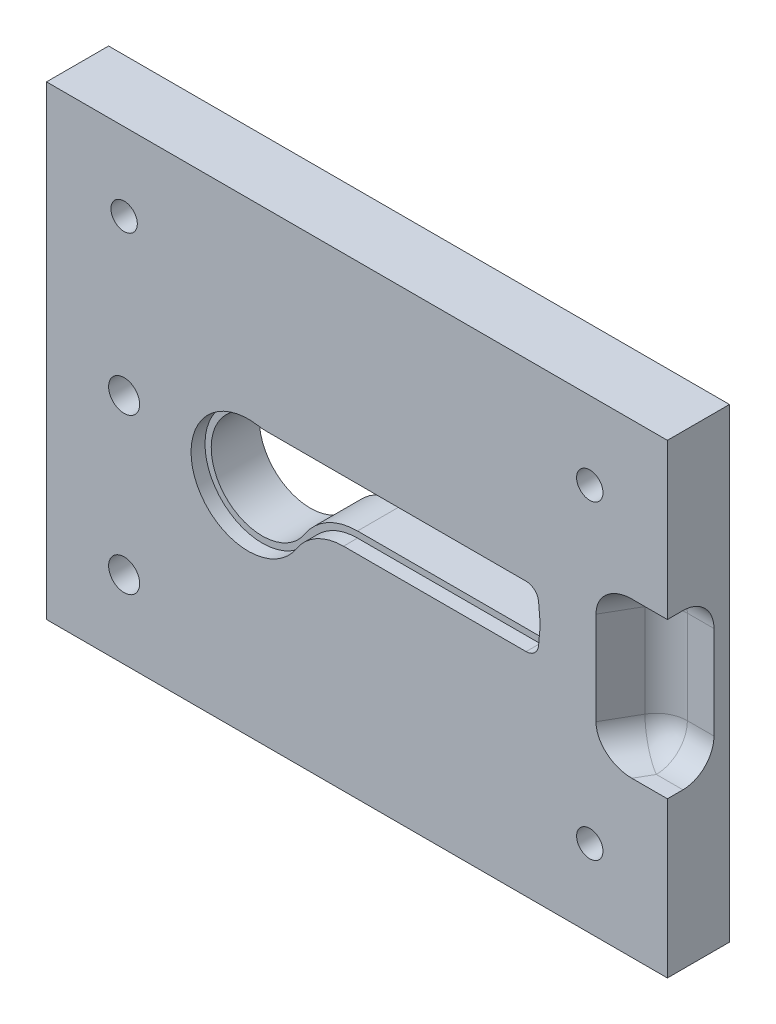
ISO-10303-21;
HEADER;
FILE_DESCRIPTION(('STEP AP214'),'2;1');
FILE_NAME('part.step','',(''),(''),'','','');
FILE_SCHEMA(('AUTOMOTIVE_DESIGN { 1 0 10303 214 1 1 1 1 }'));
ENDSEC;
DATA;
#1=APPLICATION_CONTEXT('core data for automotive mechanical design processes');
#2=APPLICATION_PROTOCOL_DEFINITION('international standard','automotive_design',2000,#1);
#3=PRODUCT_CONTEXT('',#1,'mechanical');
#4=PRODUCT('Part','Part','',(#3));
#5=PRODUCT_RELATED_PRODUCT_CATEGORY('part','',(#4));
#6=PRODUCT_DEFINITION_FORMATION('','',#4);
#7=PRODUCT_DEFINITION_CONTEXT('part definition',#1,'design');
#8=PRODUCT_DEFINITION('design','',#6,#7);
#9=PRODUCT_DEFINITION_SHAPE('','',#8);
#10=(LENGTH_UNIT() NAMED_UNIT(*) SI_UNIT(.MILLI.,.METRE.));
#11=(NAMED_UNIT(*) PLANE_ANGLE_UNIT() SI_UNIT($,.RADIAN.));
#12=(NAMED_UNIT(*) SI_UNIT($,.STERADIAN.) SOLID_ANGLE_UNIT());
#13=UNCERTAINTY_MEASURE_WITH_UNIT(LENGTH_MEASURE(1.E-05),#10,'distance_accuracy_value','');
#14=(GEOMETRIC_REPRESENTATION_CONTEXT(3) GLOBAL_UNCERTAINTY_ASSIGNED_CONTEXT((#13)) GLOBAL_UNIT_ASSIGNED_CONTEXT((#10,
#11,#12)) REPRESENTATION_CONTEXT('',''));
#15=CARTESIAN_POINT('',(0.,0.,0.));
#16=DIRECTION('',(0.,0.,1.));
#17=DIRECTION('',(1.,0.,0.));
#18=AXIS2_PLACEMENT_3D('',#15,#16,#17);
#19=CARTESIAN_POINT('',(25.,75.,20.));
#20=DIRECTION('',(0.,0.,1.));
#21=DIRECTION('',(1.,0.,0.));
#22=AXIS2_PLACEMENT_3D('',#19,#20,#21);
#23=CYLINDRICAL_SURFACE('',#22,4.99999999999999);
#24=CARTESIAN_POINT('',(25.,75.,20.));
#25=DIRECTION('',(0.,0.,1.));
#26=DIRECTION('',(1.,0.,0.));
#27=AXIS2_PLACEMENT_3D('',#24,#25,#26);
#28=CIRCLE('',#27,4.99999999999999);
#29=CARTESIAN_POINT('',(30.,75.,20.));
#30=VERTEX_POINT('',#29);
#31=EDGE_CURVE('E1024',#30,#30,#28,.T.);
#32=ORIENTED_EDGE('',*,*,#31,.T.);
#33=EDGE_LOOP('',(#32));
#34=FACE_BOUND('',#33,.T.);
#35=CARTESIAN_POINT('',(25.,75.,5.));
#36=DIRECTION('',(0.,0.,-1.));
#37=DIRECTION('',(-1.,0.,0.));
#38=AXIS2_PLACEMENT_3D('',#35,#36,#37);
#39=CIRCLE('',#38,4.99999999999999);
#40=CARTESIAN_POINT('',(20.,75.,5.));
#41=VERTEX_POINT('',#40);
#42=EDGE_CURVE('E35',#41,#41,#39,.F.);
#43=ORIENTED_EDGE('',*,*,#42,.F.);
#44=EDGE_LOOP('',(#43));
#45=FACE_BOUND('',#44,.T.);
#46=ADVANCED_FACE('F31',(#34,#45),#23,.F.);
#47=CARTESIAN_POINT('',(175.,125.,20.));
#48=DIRECTION('',(0.,0.,1.));
#49=DIRECTION('',(1.,0.,0.));
#50=AXIS2_PLACEMENT_3D('',#47,#48,#49);
#51=CYLINDRICAL_SURFACE('',#50,4.24999999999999);
#52=CARTESIAN_POINT('',(175.,125.,20.));
#53=DIRECTION('',(0.,0.,1.));
#54=DIRECTION('',(1.,0.,0.));
#55=AXIS2_PLACEMENT_3D('',#52,#53,#54);
#56=CIRCLE('',#55,4.24999999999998);
#57=CARTESIAN_POINT('',(179.25,125.,20.));
#58=VERTEX_POINT('',#57);
#59=EDGE_CURVE('E284',#58,#58,#56,.T.);
#60=ORIENTED_EDGE('',*,*,#59,.T.);
#61=EDGE_LOOP('',(#60));
#62=FACE_BOUND('',#61,.T.);
#63=CARTESIAN_POINT('',(175.,125.,5.));
#64=DIRECTION('',(0.,0.,-1.));
#65=DIRECTION('',(-1.,0.,0.));
#66=AXIS2_PLACEMENT_3D('',#63,#64,#65);
#67=CIRCLE('',#66,4.24999999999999);
#68=CARTESIAN_POINT('',(170.75,125.,5.));
#69=VERTEX_POINT('',#68);
#70=EDGE_CURVE('E291',#69,#69,#67,.F.);
#71=ORIENTED_EDGE('',*,*,#70,.F.);
#72=EDGE_LOOP('',(#71));
#73=FACE_BOUND('',#72,.T.);
#74=ADVANCED_FACE('F572',(#62,#73),#51,.F.);
#75=CARTESIAN_POINT('',(175.,25.,20.));
#76=DIRECTION('',(0.,0.,1.));
#77=DIRECTION('',(1.,0.,0.));
#78=AXIS2_PLACEMENT_3D('',#75,#76,#77);
#79=CYLINDRICAL_SURFACE('',#78,4.24999999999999);
#80=CARTESIAN_POINT('',(175.,25.,20.));
#81=DIRECTION('',(0.,0.,1.));
#82=DIRECTION('',(1.,0.,0.));
#83=AXIS2_PLACEMENT_3D('',#80,#81,#82);
#84=CIRCLE('',#83,4.24999999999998);
#85=CARTESIAN_POINT('',(179.25,25.,20.));
#86=VERTEX_POINT('',#85);
#87=EDGE_CURVE('E374',#86,#86,#84,.T.);
#88=ORIENTED_EDGE('',*,*,#87,.T.);
#89=EDGE_LOOP('',(#88));
#90=FACE_BOUND('',#89,.T.);
#91=CARTESIAN_POINT('',(175.,25.,5.));
#92=DIRECTION('',(0.,0.,-1.));
#93=DIRECTION('',(-1.,0.,0.));
#94=AXIS2_PLACEMENT_3D('',#91,#92,#93);
#95=CIRCLE('',#94,4.24999999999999);
#96=CARTESIAN_POINT('',(170.75,25.,5.));
#97=VERTEX_POINT('',#96);
#98=EDGE_CURVE('E286',#97,#97,#95,.F.);
#99=ORIENTED_EDGE('',*,*,#98,.F.);
#100=EDGE_LOOP('',(#99));
#101=FACE_BOUND('',#100,.T.);
#102=ADVANCED_FACE('F578',(#90,#101),#79,.F.);
#103=CARTESIAN_POINT('',(25.,125.,20.));
#104=DIRECTION('',(0.,0.,1.));
#105=DIRECTION('',(1.,0.,0.));
#106=AXIS2_PLACEMENT_3D('',#103,#104,#105);
#107=CYLINDRICAL_SURFACE('',#106,4.24999999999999);
#108=CARTESIAN_POINT('',(25.,125.,20.));
#109=DIRECTION('',(0.,0.,1.));
#110=DIRECTION('',(1.,0.,0.));
#111=AXIS2_PLACEMENT_3D('',#108,#109,#110);
#112=CIRCLE('',#111,4.24999999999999);
#113=CARTESIAN_POINT('',(29.25,125.,20.));
#114=VERTEX_POINT('',#113);
#115=EDGE_CURVE('E371',#114,#114,#112,.T.);
#116=ORIENTED_EDGE('',*,*,#115,.T.);
#117=EDGE_LOOP('',(#116));
#118=FACE_BOUND('',#117,.T.);
#119=CARTESIAN_POINT('',(25.,125.,5.));
#120=DIRECTION('',(0.,0.,-1.));
#121=DIRECTION('',(-1.,0.,0.));
#122=AXIS2_PLACEMENT_3D('',#119,#120,#121);
#123=CIRCLE('',#122,4.24999999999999);
#124=CARTESIAN_POINT('',(20.75,125.,5.));
#125=VERTEX_POINT('',#124);
#126=EDGE_CURVE('E281',#125,#125,#123,.F.);
#127=ORIENTED_EDGE('',*,*,#126,.F.);
#128=EDGE_LOOP('',(#127));
#129=FACE_BOUND('',#128,.T.);
#130=ADVANCED_FACE('F631',(#118,#129),#107,.F.);
#131=CARTESIAN_POINT('',(0.,150.,0.));
#132=DIRECTION('',(0.,0.,-1.));
#133=DIRECTION('',(-1.,0.,0.));
#134=AXIS2_PLACEMENT_3D('',#131,#132,#133);
#135=PLANE('',#134);
#136=CARTESIAN_POINT('',(25.,75.,0.));
#137=DIRECTION('',(0.,0.,-1.));
#138=DIRECTION('',(-1.,0.,0.));
#139=AXIS2_PLACEMENT_3D('',#136,#137,#138);
#140=CIRCLE('',#139,13.);
#141=CARTESIAN_POINT('',(12.,75.,0.));
#142=VERTEX_POINT('',#141);
#143=EDGE_CURVE('E1020',#142,#142,#140,.T.);
#144=ORIENTED_EDGE('',*,*,#143,.F.);
#145=EDGE_LOOP('',(#144));
#146=FACE_BOUND('',#145,.T.);
#147=CARTESIAN_POINT('',(175.,125.,0.));
#148=DIRECTION('',(0.,0.,-1.));
#149=DIRECTION('',(-1.,0.,0.));
#150=AXIS2_PLACEMENT_3D('',#147,#148,#149);
#151=CIRCLE('',#150,13.);
#152=CARTESIAN_POINT('',(162.,125.,0.));
#153=VERTEX_POINT('',#152);
#154=EDGE_CURVE('E233',#153,#153,#151,.T.);
#155=ORIENTED_EDGE('',*,*,#154,.F.);
#156=EDGE_LOOP('',(#155));
#157=FACE_BOUND('',#156,.T.);
#158=CARTESIAN_POINT('',(175.,25.,0.));
#159=DIRECTION('',(0.,0.,-1.));
#160=DIRECTION('',(-1.,0.,0.));
#161=AXIS2_PLACEMENT_3D('',#158,#159,#160);
#162=CIRCLE('',#161,13.);
#163=CARTESIAN_POINT('',(162.,25.,0.));
#164=VERTEX_POINT('',#163);
#165=EDGE_CURVE('E294',#164,#164,#162,.T.);
#166=ORIENTED_EDGE('',*,*,#165,.F.);
#167=EDGE_LOOP('',(#166));
#168=FACE_BOUND('',#167,.T.);
#169=CARTESIAN_POINT('',(25.,25.,0.));
#170=DIRECTION('',(0.,0.,-1.));
#171=DIRECTION('',(-1.,0.,0.));
#172=AXIS2_PLACEMENT_3D('',#169,#170,#171);
#173=CIRCLE('',#172,13.);
#174=CARTESIAN_POINT('',(12.,25.,0.));
#175=VERTEX_POINT('',#174);
#176=EDGE_CURVE('E289',#175,#175,#173,.T.);
#177=ORIENTED_EDGE('',*,*,#176,.F.);
#178=EDGE_LOOP('',(#177));
#179=FACE_BOUND('',#178,.T.);
#180=CARTESIAN_POINT('',(25.,125.,0.));
#181=DIRECTION('',(0.,0.,-1.));
#182=DIRECTION('',(-1.,0.,0.));
#183=AXIS2_PLACEMENT_3D('',#180,#181,#182);
#184=CIRCLE('',#183,13.);
#185=CARTESIAN_POINT('',(12.,125.,0.));
#186=VERTEX_POINT('',#185);
#187=EDGE_CURVE('E362',#186,#186,#184,.T.);
#188=ORIENTED_EDGE('',*,*,#187,.F.);
#189=EDGE_LOOP('',(#188));
#190=FACE_BOUND('',#189,.T.);
#191=DIRECTION('',(0.,-1.,0.));
#192=VECTOR('',#191,1.);
#193=CARTESIAN_POINT('',(0.,0.,0.));
#194=LINE('',#193,#192);
#195=CARTESIAN_POINT('',(0.,150.,0.));
#196=VERTEX_POINT('',#195);
#197=CARTESIAN_POINT('',(0.,0.,0.));
#198=VERTEX_POINT('',#197);
#199=EDGE_CURVE('E257',#196,#198,#194,.T.);
#200=ORIENTED_EDGE('',*,*,#199,.F.);
#201=DIRECTION('',(-1.,0.,0.));
#202=VECTOR('',#201,1.);
#203=CARTESIAN_POINT('',(0.,150.,0.));
#204=LINE('',#203,#202);
#205=CARTESIAN_POINT('',(200.,150.,0.));
#206=VERTEX_POINT('',#205);
#207=EDGE_CURVE('E265',#206,#196,#204,.T.);
#208=ORIENTED_EDGE('',*,*,#207,.F.);
#209=DIRECTION('',(0.,1.,0.));
#210=VECTOR('',#209,1.);
#211=CARTESIAN_POINT('',(200.,0.,0.));
#212=LINE('',#211,#210);
#213=CARTESIAN_POINT('',(200.,0.,0.));
#214=VERTEX_POINT('',#213);
#215=EDGE_CURVE('E263',#214,#206,#212,.T.);
#216=ORIENTED_EDGE('',*,*,#215,.F.);
#217=DIRECTION('',(1.,0.,0.));
#218=VECTOR('',#217,1.);
#219=CARTESIAN_POINT('',(0.,0.,0.));
#220=LINE('',#219,#218);
#221=EDGE_CURVE('E260',#198,#214,#220,.T.);
#222=ORIENTED_EDGE('',*,*,#221,.F.);
#223=EDGE_LOOP('',(#200,#208,#216,#222));
#224=FACE_BOUND('',#223,.T.);
#225=CARTESIAN_POINT('',(71.0781905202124,105.965,0.));
#226=DIRECTION('',(0.,0.,-1.));
#227=DIRECTION('',(-1.,0.,0.));
#228=AXIS2_PLACEMENT_3D('',#225,#226,#227);
#229=CIRCLE('',#228,20.03);
#230=CARTESIAN_POINT('',(71.0781905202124,85.935,0.));
#231=VERTEX_POINT('',#230);
#232=CARTESIAN_POINT('',(67.7403932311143,86.2150630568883,0.));
#233=VERTEX_POINT('',#232);
#234=EDGE_CURVE('E465',#231,#233,#229,.T.);
#235=ORIENTED_EDGE('',*,*,#234,.T.);
#236=CARTESIAN_POINT('',(65.,70.,0.));
#237=DIRECTION('',(0.,0.,1.));
#238=DIRECTION('',(1.,0.,0.));
#239=AXIS2_PLACEMENT_3D('',#236,#237,#238);
#240=CIRCLE('',#239,16.445);
#241=CARTESIAN_POINT('',(78.8329287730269,61.1068505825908,0.));
#242=VERTEX_POINT('',#241);
#243=EDGE_CURVE('E468',#233,#242,#240,.T.);
#244=ORIENTED_EDGE('',*,*,#243,.T.);
#245=CARTESIAN_POINT('',(95.6814276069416,50.275,0.));
#246=DIRECTION('',(0.,0.,-1.));
#247=DIRECTION('',(1.,0.,0.));
#248=AXIS2_PLACEMENT_3D('',#245,#246,#247);
#249=CIRCLE('',#248,20.03);
#250=CARTESIAN_POINT('',(95.6814276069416,70.305,0.));
#251=VERTEX_POINT('',#250);
#252=EDGE_CURVE('E471',#242,#251,#249,.T.);
#253=ORIENTED_EDGE('',*,*,#252,.T.);
#254=DIRECTION('',(1.,0.,0.));
#255=VECTOR('',#254,1.);
#256=CARTESIAN_POINT('',(95.6814276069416,70.305,0.));
#257=LINE('',#256,#255);
#258=CARTESIAN_POINT('',(154.489847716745,70.305,0.));
#259=VERTEX_POINT('',#258);
#260=EDGE_CURVE('E474',#251,#259,#257,.T.);
#261=ORIENTED_EDGE('',*,*,#260,.T.);
#262=CARTESIAN_POINT('',(154.489847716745,72.335,0.));
#263=DIRECTION('',(0.,0.,1.));
#264=DIRECTION('',(1.,0.,0.));
#265=AXIS2_PLACEMENT_3D('',#262,#263,#264);
#266=CIRCLE('',#265,2.03);
#267=CARTESIAN_POINT('',(156.512122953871,72.1580738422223,0.));
#268=VERTEX_POINT('',#267);
#269=EDGE_CURVE('E477',#259,#268,#266,.T.);
#270=ORIENTED_EDGE('',*,*,#269,.T.);
#271=DIRECTION('',(0.0871557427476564,0.996194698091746,0.));
#272=VECTOR('',#271,1.);
#273=CARTESIAN_POINT('',(156.512122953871,72.1580738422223,0.));
#274=LINE('',#273,#272);
#275=CARTESIAN_POINT('',(157.033723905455,78.12,0.));
#276=VERTEX_POINT('',#275);
#277=EDGE_CURVE('E480',#268,#276,#274,.T.);
#278=ORIENTED_EDGE('',*,*,#277,.T.);
#279=DIRECTION('',(-0.0871557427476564,0.996194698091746,0.));
#280=VECTOR('',#279,1.);
#281=CARTESIAN_POINT('',(156.512122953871,84.0819261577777,0.));
#282=LINE('',#281,#280);
#283=CARTESIAN_POINT('',(156.512122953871,84.0819261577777,0.));
#284=VERTEX_POINT('',#283);
#285=EDGE_CURVE('E483',#276,#284,#282,.T.);
#286=ORIENTED_EDGE('',*,*,#285,.T.);
#287=CARTESIAN_POINT('',(154.489847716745,83.905,0.));
#288=DIRECTION('',(0.,0.,1.));
#289=DIRECTION('',(-1.,0.,0.));
#290=AXIS2_PLACEMENT_3D('',#287,#288,#289);
#291=CIRCLE('',#290,2.03);
#292=CARTESIAN_POINT('',(154.489847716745,85.935,0.));
#293=VERTEX_POINT('',#292);
#294=EDGE_CURVE('E486',#284,#293,#291,.T.);
#295=ORIENTED_EDGE('',*,*,#294,.T.);
#296=DIRECTION('',(-1.,0.,0.));
#297=VECTOR('',#296,1.);
#298=CARTESIAN_POINT('',(71.0781905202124,85.935,0.));
#299=LINE('',#298,#297);
#300=EDGE_CURVE('E489',#293,#231,#299,.T.);
#301=ORIENTED_EDGE('',*,*,#300,.T.);
#302=EDGE_LOOP('',(#235,#244,#253,#261,#270,#278,#286,#295,#301));
#303=FACE_BOUND('',#302,.T.);
#304=ADVANCED_FACE('F530',(#146,#157,#168,#179,#190,#224,#303),#135,.T.);
#305=CARTESIAN_POINT('',(71.0781905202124,105.965,0.));
#306=DIRECTION('',(0.,0.,1.));
#307=DIRECTION('',(1.,0.,0.));
#308=AXIS2_PLACEMENT_3D('',#305,#306,#307);
#309=CYLINDRICAL_SURFACE('',#308,20.03);
#310=CARTESIAN_POINT('',(71.0781905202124,105.965,15.5));
#311=DIRECTION('',(0.,0.,1.));
#312=DIRECTION('',(1.,0.,0.));
#313=AXIS2_PLACEMENT_3D('',#310,#311,#312);
#314=CIRCLE('',#313,20.03);
#315=CARTESIAN_POINT('',(67.7403932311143,86.2150630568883,15.5));
#316=VERTEX_POINT('',#315);
#317=CARTESIAN_POINT('',(71.0781905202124,85.935,15.5));
#318=VERTEX_POINT('',#317);
#319=EDGE_CURVE('E463',#316,#318,#314,.T.);
#320=ORIENTED_EDGE('',*,*,#319,.F.);
#321=DIRECTION('',(0.,0.,1.));
#322=VECTOR('',#321,1.);
#323=CARTESIAN_POINT('',(67.7403932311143,86.2150630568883,0.));
#324=LINE('',#323,#322);
#325=EDGE_CURVE('E492',#233,#316,#324,.T.);
#326=ORIENTED_EDGE('',*,*,#325,.F.);
#327=ORIENTED_EDGE('',*,*,#234,.F.);
#328=DIRECTION('',(0.,0.,1.));
#329=VECTOR('',#328,1.);
#330=CARTESIAN_POINT('',(71.0781905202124,85.935,0.));
#331=LINE('',#330,#329);
#332=EDGE_CURVE('E261',#231,#318,#331,.T.);
#333=ORIENTED_EDGE('',*,*,#332,.T.);
#334=EDGE_LOOP('',(#320,#326,#327,#333));
#335=FACE_BOUND('',#334,.T.);
#336=ADVANCED_FACE('F681',(#335),#309,.T.);
#337=CARTESIAN_POINT('',(71.0781905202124,85.935,0.));
#338=DIRECTION('',(0.,1.,0.));
#339=DIRECTION('',(-1.,0.,0.));
#340=AXIS2_PLACEMENT_3D('',#337,#338,#339);
#341=PLANE('',#340);
#342=DIRECTION('',(1.,0.,0.));
#343=VECTOR('',#342,1.);
#344=CARTESIAN_POINT('',(71.0781905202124,85.935,15.5));
#345=LINE('',#344,#343);
#346=CARTESIAN_POINT('',(154.489847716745,85.935,15.5));
#347=VERTEX_POINT('',#346);
#348=EDGE_CURVE('E461',#318,#347,#345,.T.);
#349=ORIENTED_EDGE('',*,*,#348,.F.);
#350=ORIENTED_EDGE('',*,*,#332,.F.);
#351=ORIENTED_EDGE('',*,*,#300,.F.);
#352=DIRECTION('',(0.,0.,1.));
#353=VECTOR('',#352,1.);
#354=CARTESIAN_POINT('',(154.489847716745,85.935,0.));
#355=LINE('',#354,#353);
#356=EDGE_CURVE('E495',#293,#347,#355,.T.);
#357=ORIENTED_EDGE('',*,*,#356,.T.);
#358=EDGE_LOOP('',(#349,#350,#351,#357));
#359=FACE_BOUND('',#358,.T.);
#360=ADVANCED_FACE('F677',(#359),#341,.F.);
#361=CARTESIAN_POINT('',(154.489847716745,83.905,0.));
#362=DIRECTION('',(0.,0.,1.));
#363=DIRECTION('',(1.,0.,0.));
#364=AXIS2_PLACEMENT_3D('',#361,#362,#363);
#365=CYLINDRICAL_SURFACE('',#364,2.03);
#366=CARTESIAN_POINT('',(154.489847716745,83.905,15.5));
#367=DIRECTION('',(0.,0.,1.));
#368=DIRECTION('',(1.,0.,0.));
#369=AXIS2_PLACEMENT_3D('',#366,#367,#368);
#370=CIRCLE('',#369,2.03);
#371=CARTESIAN_POINT('',(156.512122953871,84.0819261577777,15.5));
#372=VERTEX_POINT('',#371);
#373=EDGE_CURVE('E459',#347,#372,#370,.F.);
#374=ORIENTED_EDGE('',*,*,#373,.F.);
#375=ORIENTED_EDGE('',*,*,#356,.F.);
#376=ORIENTED_EDGE('',*,*,#294,.F.);
#377=DIRECTION('',(0.,0.,1.));
#378=VECTOR('',#377,1.);
#379=CARTESIAN_POINT('',(156.512122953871,84.0819261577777,0.));
#380=LINE('',#379,#378);
#381=EDGE_CURVE('E498',#284,#372,#380,.T.);
#382=ORIENTED_EDGE('',*,*,#381,.T.);
#383=EDGE_LOOP('',(#374,#375,#376,#382));
#384=FACE_BOUND('',#383,.T.);
#385=ADVANCED_FACE('F680',(#384),#365,.F.);
#386=CARTESIAN_POINT('',(156.512122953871,84.0819261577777,0.));
#387=DIRECTION('',(0.996194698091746,0.0871557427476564,0.));
#388=DIRECTION('',(-0.0871557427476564,0.996194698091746,0.));
#389=AXIS2_PLACEMENT_3D('',#386,#387,#388);
#390=PLANE('',#389);
#391=DIRECTION('',(0.0871557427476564,-0.996194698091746,0.));
#392=VECTOR('',#391,1.);
#393=CARTESIAN_POINT('',(156.512122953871,84.0819261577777,15.5));
#394=LINE('',#393,#392);
#395=CARTESIAN_POINT('',(157.033723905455,78.12,15.5));
#396=VERTEX_POINT('',#395);
#397=EDGE_CURVE('E457',#372,#396,#394,.T.);
#398=ORIENTED_EDGE('',*,*,#397,.F.);
#399=ORIENTED_EDGE('',*,*,#381,.F.);
#400=ORIENTED_EDGE('',*,*,#285,.F.);
#401=DIRECTION('',(0.,0.,1.));
#402=VECTOR('',#401,1.);
#403=CARTESIAN_POINT('',(157.033723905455,78.12,0.));
#404=LINE('',#403,#402);
#405=EDGE_CURVE('E501',#276,#396,#404,.T.);
#406=ORIENTED_EDGE('',*,*,#405,.T.);
#407=EDGE_LOOP('',(#398,#399,#400,#406));
#408=FACE_BOUND('',#407,.T.);
#409=ADVANCED_FACE('F685',(#408),#390,.F.);
#410=CARTESIAN_POINT('',(156.512122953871,72.1580738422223,0.));
#411=DIRECTION('',(0.996194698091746,-0.0871557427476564,0.));
#412=DIRECTION('',(0.0871557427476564,0.996194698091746,0.));
#413=AXIS2_PLACEMENT_3D('',#410,#411,#412);
#414=PLANE('',#413);
#415=DIRECTION('',(-0.0871557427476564,-0.996194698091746,0.));
#416=VECTOR('',#415,1.);
#417=CARTESIAN_POINT('',(156.512122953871,72.1580738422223,15.5));
#418=LINE('',#417,#416);
#419=CARTESIAN_POINT('',(156.512122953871,72.1580738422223,15.5));
#420=VERTEX_POINT('',#419);
#421=EDGE_CURVE('E455',#396,#420,#418,.T.);
#422=ORIENTED_EDGE('',*,*,#421,.F.);
#423=ORIENTED_EDGE('',*,*,#405,.F.);
#424=ORIENTED_EDGE('',*,*,#277,.F.);
#425=DIRECTION('',(0.,0.,1.));
#426=VECTOR('',#425,1.);
#427=CARTESIAN_POINT('',(156.512122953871,72.1580738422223,0.));
#428=LINE('',#427,#426);
#429=EDGE_CURVE('E504',#268,#420,#428,.T.);
#430=ORIENTED_EDGE('',*,*,#429,.T.);
#431=EDGE_LOOP('',(#422,#423,#424,#430));
#432=FACE_BOUND('',#431,.T.);
#433=ADVANCED_FACE('F689',(#432),#414,.F.);
#434=CARTESIAN_POINT('',(154.489847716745,72.335,0.));
#435=DIRECTION('',(0.,0.,1.));
#436=DIRECTION('',(1.,0.,0.));
#437=AXIS2_PLACEMENT_3D('',#434,#435,#436);
#438=CYLINDRICAL_SURFACE('',#437,2.03);
#439=CARTESIAN_POINT('',(154.489847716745,72.335,15.5));
#440=DIRECTION('',(0.,0.,1.));
#441=DIRECTION('',(1.,0.,0.));
#442=AXIS2_PLACEMENT_3D('',#439,#440,#441);
#443=CIRCLE('',#442,2.03);
#444=CARTESIAN_POINT('',(154.489847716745,70.305,15.5));
#445=VERTEX_POINT('',#444);
#446=EDGE_CURVE('E453',#420,#445,#443,.F.);
#447=ORIENTED_EDGE('',*,*,#446,.F.);
#448=ORIENTED_EDGE('',*,*,#429,.F.);
#449=ORIENTED_EDGE('',*,*,#269,.F.);
#450=DIRECTION('',(0.,0.,1.));
#451=VECTOR('',#450,1.);
#452=CARTESIAN_POINT('',(154.489847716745,70.305,0.));
#453=LINE('',#452,#451);
#454=EDGE_CURVE('E507',#259,#445,#453,.T.);
#455=ORIENTED_EDGE('',*,*,#454,.T.);
#456=EDGE_LOOP('',(#447,#448,#449,#455));
#457=FACE_BOUND('',#456,.T.);
#458=ADVANCED_FACE('F693',(#457),#438,.F.);
#459=CARTESIAN_POINT('',(95.6814276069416,70.305,0.));
#460=DIRECTION('',(0.,-1.,0.));
#461=DIRECTION('',(1.,0.,0.));
#462=AXIS2_PLACEMENT_3D('',#459,#460,#461);
#463=PLANE('',#462);
#464=DIRECTION('',(-1.,0.,0.));
#465=VECTOR('',#464,1.);
#466=CARTESIAN_POINT('',(95.6814276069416,70.305,15.5));
#467=LINE('',#466,#465);
#468=CARTESIAN_POINT('',(95.6814276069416,70.305,15.5));
#469=VERTEX_POINT('',#468);
#470=EDGE_CURVE('E451',#445,#469,#467,.T.);
#471=ORIENTED_EDGE('',*,*,#470,.F.);
#472=ORIENTED_EDGE('',*,*,#454,.F.);
#473=ORIENTED_EDGE('',*,*,#260,.F.);
#474=DIRECTION('',(0.,0.,1.));
#475=VECTOR('',#474,1.);
#476=CARTESIAN_POINT('',(95.6814276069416,70.305,0.));
#477=LINE('',#476,#475);
#478=EDGE_CURVE('E510',#251,#469,#477,.T.);
#479=ORIENTED_EDGE('',*,*,#478,.T.);
#480=EDGE_LOOP('',(#471,#472,#473,#479));
#481=FACE_BOUND('',#480,.T.);
#482=ADVANCED_FACE('F697',(#481),#463,.F.);
#483=CARTESIAN_POINT('',(95.6814276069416,50.275,0.));
#484=DIRECTION('',(0.,0.,1.));
#485=DIRECTION('',(1.,0.,0.));
#486=AXIS2_PLACEMENT_3D('',#483,#484,#485);
#487=CYLINDRICAL_SURFACE('',#486,20.03);
#488=CARTESIAN_POINT('',(95.6814276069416,50.275,15.5));
#489=DIRECTION('',(0.,0.,1.));
#490=DIRECTION('',(1.,0.,0.));
#491=AXIS2_PLACEMENT_3D('',#488,#489,#490);
#492=CIRCLE('',#491,20.03);
#493=CARTESIAN_POINT('',(78.8329287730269,61.1068505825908,15.5));
#494=VERTEX_POINT('',#493);
#495=EDGE_CURVE('E433',#469,#494,#492,.T.);
#496=ORIENTED_EDGE('',*,*,#495,.F.);
#497=ORIENTED_EDGE('',*,*,#478,.F.);
#498=ORIENTED_EDGE('',*,*,#252,.F.);
#499=DIRECTION('',(0.,0.,1.));
#500=VECTOR('',#499,1.);
#501=CARTESIAN_POINT('',(78.8329287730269,61.1068505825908,0.));
#502=LINE('',#501,#500);
#503=EDGE_CURVE('E513',#242,#494,#502,.T.);
#504=ORIENTED_EDGE('',*,*,#503,.T.);
#505=EDGE_LOOP('',(#496,#497,#498,#504));
#506=FACE_BOUND('',#505,.T.);
#507=ADVANCED_FACE('F701',(#506),#487,.T.);
#508=CARTESIAN_POINT('',(65.,70.,0.));
#509=DIRECTION('',(0.,0.,1.));
#510=DIRECTION('',(1.,0.,0.));
#511=AXIS2_PLACEMENT_3D('',#508,#509,#510);
#512=CYLINDRICAL_SURFACE('',#511,16.445);
#513=CARTESIAN_POINT('',(65.,70.,15.5));
#514=DIRECTION('',(0.,0.,1.));
#515=DIRECTION('',(1.,0.,0.));
#516=AXIS2_PLACEMENT_3D('',#513,#514,#515);
#517=CIRCLE('',#516,16.445);
#518=EDGE_CURVE('E278',#494,#316,#517,.F.);
#519=ORIENTED_EDGE('',*,*,#518,.F.);
#520=ORIENTED_EDGE('',*,*,#503,.F.);
#521=ORIENTED_EDGE('',*,*,#243,.F.);
#522=ORIENTED_EDGE('',*,*,#325,.T.);
#523=EDGE_LOOP('',(#519,#520,#521,#522));
#524=FACE_BOUND('',#523,.T.);
#525=ADVANCED_FACE('F705',(#524),#512,.F.);
#526=CARTESIAN_POINT('',(0.,0.,20.));
#527=DIRECTION('',(1.,0.,0.));
#528=DIRECTION('',(0.,0.,-1.));
#529=AXIS2_PLACEMENT_3D('',#526,#527,#528);
#530=PLANE('',#529);
#531=ORIENTED_EDGE('',*,*,#199,.T.);
#532=DIRECTION('',(0.,0.,-1.));
#533=VECTOR('',#532,1.);
#534=CARTESIAN_POINT('',(0.,0.,20.));
#535=LINE('',#534,#533);
#536=CARTESIAN_POINT('',(0.,0.,20.));
#537=VERTEX_POINT('',#536);
#538=EDGE_CURVE('E275',#537,#198,#535,.T.);
#539=ORIENTED_EDGE('',*,*,#538,.F.);
#540=DIRECTION('',(0.,-1.,0.));
#541=VECTOR('',#540,1.);
#542=CARTESIAN_POINT('',(0.,0.,20.));
#543=LINE('',#542,#541);
#544=CARTESIAN_POINT('',(0.,150.,20.));
#545=VERTEX_POINT('',#544);
#546=EDGE_CURVE('E267',#545,#537,#543,.T.);
#547=ORIENTED_EDGE('',*,*,#546,.F.);
#548=DIRECTION('',(0.,0.,-1.));
#549=VECTOR('',#548,1.);
#550=CARTESIAN_POINT('',(0.,150.,20.));
#551=LINE('',#550,#549);
#552=EDGE_CURVE('E252',#545,#196,#551,.T.);
#553=ORIENTED_EDGE('',*,*,#552,.T.);
#554=EDGE_LOOP('',(#531,#539,#547,#553));
#555=FACE_BOUND('',#554,.T.);
#556=ADVANCED_FACE('F522',(#555),#530,.F.);
#557=CARTESIAN_POINT('',(0.,0.,20.));
#558=DIRECTION('',(0.,1.,0.));
#559=DIRECTION('',(0.,0.,1.));
#560=AXIS2_PLACEMENT_3D('',#557,#558,#559);
#561=PLANE('',#560);
#562=ORIENTED_EDGE('',*,*,#221,.T.);
#563=DIRECTION('',(0.,0.,-1.));
#564=VECTOR('',#563,1.);
#565=CARTESIAN_POINT('',(200.,0.,20.));
#566=LINE('',#565,#564);
#567=CARTESIAN_POINT('',(200.,0.,20.));
#568=VERTEX_POINT('',#567);
#569=EDGE_CURVE('E273',#568,#214,#566,.T.);
#570=ORIENTED_EDGE('',*,*,#569,.F.);
#571=DIRECTION('',(1.,0.,0.));
#572=VECTOR('',#571,1.);
#573=CARTESIAN_POINT('',(0.,0.,20.));
#574=LINE('',#573,#572);
#575=EDGE_CURVE('E247',#537,#568,#574,.T.);
#576=ORIENTED_EDGE('',*,*,#575,.F.);
#577=ORIENTED_EDGE('',*,*,#538,.T.);
#578=EDGE_LOOP('',(#562,#570,#576,#577));
#579=FACE_BOUND('',#578,.T.);
#580=ADVANCED_FACE('F525',(#579),#561,.F.);
#581=CARTESIAN_POINT('',(200.,0.,20.));
#582=DIRECTION('',(-1.,0.,0.));
#583=DIRECTION('',(0.,0.,1.));
#584=AXIS2_PLACEMENT_3D('',#581,#582,#583);
#585=PLANE('',#584);
#586=DIRECTION('',(0.,1.,0.));
#587=VECTOR('',#586,1.);
#588=CARTESIAN_POINT('',(200.,100.,5.));
#589=LINE('',#588,#587);
#590=CARTESIAN_POINT('',(200.,60.,5.));
#591=VERTEX_POINT('',#590);
#592=CARTESIAN_POINT('',(200.,90.,5.));
#593=VERTEX_POINT('',#592);
#594=EDGE_CURVE('E242',#591,#593,#589,.T.);
#595=ORIENTED_EDGE('',*,*,#594,.F.);
#596=CARTESIAN_POINT('',(200.,60.,15.));
#597=DIRECTION('',(-1.,0.,0.));
#598=DIRECTION('',(0.,0.,1.));
#599=AXIS2_PLACEMENT_3D('',#596,#597,#598);
#600=CIRCLE('',#599,10.);
#601=CARTESIAN_POINT('',(200.,50.,15.));
#602=VERTEX_POINT('',#601);
#603=EDGE_CURVE('E11',#591,#602,#600,.T.);
#604=ORIENTED_EDGE('',*,*,#603,.T.);
#605=DIRECTION('',(0.,0.,1.));
#606=VECTOR('',#605,1.);
#607=CARTESIAN_POINT('',(200.,50.,5.));
#608=LINE('',#607,#606);
#609=CARTESIAN_POINT('',(200.,50.,20.));
#610=VERTEX_POINT('',#609);
#611=EDGE_CURVE('E227',#602,#610,#608,.T.);
#612=ORIENTED_EDGE('',*,*,#611,.T.);
#613=DIRECTION('',(0.,1.,0.));
#614=VECTOR('',#613,1.);
#615=CARTESIAN_POINT('',(200.,0.,20.));
#616=LINE('',#615,#614);
#617=EDGE_CURVE('E232',#568,#610,#616,.T.);
#618=ORIENTED_EDGE('',*,*,#617,.F.);
#619=ORIENTED_EDGE('',*,*,#569,.T.);
#620=ORIENTED_EDGE('',*,*,#215,.T.);
#621=DIRECTION('',(0.,0.,-1.));
#622=VECTOR('',#621,1.);
#623=CARTESIAN_POINT('',(200.,150.,20.));
#624=LINE('',#623,#622);
#625=CARTESIAN_POINT('',(200.,150.,20.));
#626=VERTEX_POINT('',#625);
#627=EDGE_CURVE('E270',#626,#206,#624,.T.);
#628=ORIENTED_EDGE('',*,*,#627,.F.);
#629=CARTESIAN_POINT('',(200.,100.,20.));
#630=VERTEX_POINT('',#629);
#631=EDGE_CURVE('E250',#630,#626,#616,.T.);
#632=ORIENTED_EDGE('',*,*,#631,.F.);
#633=DIRECTION('',(0.,0.,1.));
#634=VECTOR('',#633,1.);
#635=CARTESIAN_POINT('',(200.,100.,5.));
#636=LINE('',#635,#634);
#637=CARTESIAN_POINT('',(200.,100.,15.));
#638=VERTEX_POINT('',#637);
#639=EDGE_CURVE('E234',#638,#630,#636,.T.);
#640=ORIENTED_EDGE('',*,*,#639,.F.);
#641=CARTESIAN_POINT('',(200.,90.,15.));
#642=DIRECTION('',(-1.,0.,0.));
#643=DIRECTION('',(0.,0.,1.));
#644=AXIS2_PLACEMENT_3D('',#641,#642,#643);
#645=CIRCLE('',#644,10.);
#646=EDGE_CURVE('E316',#638,#593,#645,.T.);
#647=ORIENTED_EDGE('',*,*,#646,.T.);
#648=EDGE_LOOP('',(#595,#604,#612,#618,#619,#620,#628,#632,#640,#647));
#649=FACE_BOUND('',#648,.T.);
#650=ADVANCED_FACE('F229',(#649),#585,.F.);
#651=CARTESIAN_POINT('',(0.,150.,20.));
#652=DIRECTION('',(0.,-1.,0.));
#653=DIRECTION('',(0.,0.,-1.));
#654=AXIS2_PLACEMENT_3D('',#651,#652,#653);
#655=PLANE('',#654);
#656=ORIENTED_EDGE('',*,*,#207,.T.);
#657=ORIENTED_EDGE('',*,*,#552,.F.);
#658=DIRECTION('',(-1.,0.,0.));
#659=VECTOR('',#658,1.);
#660=CARTESIAN_POINT('',(0.,150.,20.));
#661=LINE('',#660,#659);
#662=EDGE_CURVE('E249',#626,#545,#661,.T.);
#663=ORIENTED_EDGE('',*,*,#662,.F.);
#664=ORIENTED_EDGE('',*,*,#627,.T.);
#665=EDGE_LOOP('',(#656,#657,#663,#664));
#666=FACE_BOUND('',#665,.T.);
#667=ADVANCED_FACE('F533',(#666),#655,.F.);
#668=CARTESIAN_POINT('',(0.,150.,20.));
#669=DIRECTION('',(0.,0.,-1.));
#670=DIRECTION('',(-1.,0.,0.));
#671=AXIS2_PLACEMENT_3D('',#668,#669,#670);
#672=PLANE('',#671);
#673=ORIENTED_EDGE('',*,*,#31,.F.);
#674=EDGE_LOOP('',(#673));
#675=FACE_BOUND('',#674,.T.);
#676=CARTESIAN_POINT('',(25.,25.,20.));
#677=DIRECTION('',(0.,0.,1.));
#678=DIRECTION('',(1.,0.,0.));
#679=AXIS2_PLACEMENT_3D('',#676,#677,#678);
#680=CIRCLE('',#679,4.99999999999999);
#681=CARTESIAN_POINT('',(30.,25.,20.));
#682=VERTEX_POINT('',#681);
#683=EDGE_CURVE('E1026',#682,#682,#680,.T.);
#684=ORIENTED_EDGE('',*,*,#683,.F.);
#685=EDGE_LOOP('',(#684));
#686=FACE_BOUND('',#685,.T.);
#687=ORIENTED_EDGE('',*,*,#59,.F.);
#688=EDGE_LOOP('',(#687));
#689=FACE_BOUND('',#688,.T.);
#690=ORIENTED_EDGE('',*,*,#115,.F.);
#691=EDGE_LOOP('',(#690));
#692=FACE_BOUND('',#691,.T.);
#693=ORIENTED_EDGE('',*,*,#87,.F.);
#694=EDGE_LOOP('',(#693));
#695=FACE_BOUND('',#694,.T.);
#696=DIRECTION('',(0.0871557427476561,0.996194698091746,0.));
#697=VECTOR('',#696,1.);
#698=CARTESIAN_POINT('',(158.504512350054,71.983762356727,20.));
#699=LINE('',#698,#697);
#700=CARTESIAN_POINT('',(158.504512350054,71.983762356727,20.));
#701=VERTEX_POINT('',#700);
#702=CARTESIAN_POINT('',(159.041363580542,78.12,20.));
#703=VERTEX_POINT('',#702);
#704=EDGE_CURVE('E408',#701,#703,#699,.T.);
#705=ORIENTED_EDGE('',*,*,#704,.F.);
#706=CARTESIAN_POINT('',(154.489847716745,72.335,20.));
#707=DIRECTION('',(0.,0.,1.));
#708=DIRECTION('',(1.,0.,0.));
#709=AXIS2_PLACEMENT_3D('',#706,#707,#708);
#710=CIRCLE('',#709,4.03);
#711=CARTESIAN_POINT('',(154.489847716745,68.305,20.));
#712=VERTEX_POINT('',#711);
#713=EDGE_CURVE('E377',#712,#701,#710,.T.);
#714=ORIENTED_EDGE('',*,*,#713,.F.);
#715=DIRECTION('',(1.,0.,0.));
#716=VECTOR('',#715,1.);
#717=CARTESIAN_POINT('',(95.6814276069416,68.305,20.));
#718=LINE('',#717,#716);
#719=CARTESIAN_POINT('',(95.6814276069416,68.305,20.));
#720=VERTEX_POINT('',#719);
#721=EDGE_CURVE('E382',#720,#712,#718,.T.);
#722=ORIENTED_EDGE('',*,*,#721,.F.);
#723=CARTESIAN_POINT('',(95.6814276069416,50.275,20.));
#724=DIRECTION('',(0.,0.,-1.));
#725=DIRECTION('',(1.,0.,0.));
#726=AXIS2_PLACEMENT_3D('',#723,#724,#725);
#727=CIRCLE('',#726,18.03);
#728=CARTESIAN_POINT('',(80.5152551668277,60.025287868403,20.));
#729=VERTEX_POINT('',#728);
#730=EDGE_CURVE('E426',#729,#720,#727,.T.);
#731=ORIENTED_EDGE('',*,*,#730,.F.);
#732=CARTESIAN_POINT('',(65.,70.,20.));
#733=DIRECTION('',(0.,0.,1.));
#734=DIRECTION('',(1.,0.,0.));
#735=AXIS2_PLACEMENT_3D('',#732,#733,#734);
#736=CIRCLE('',#735,18.445);
#737=CARTESIAN_POINT('',(68.0736730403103,88.1870986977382,20.));
#738=VERTEX_POINT('',#737);
#739=EDGE_CURVE('E423',#738,#729,#736,.T.);
#740=ORIENTED_EDGE('',*,*,#739,.F.);
#741=CARTESIAN_POINT('',(71.0781905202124,105.965,20.));
#742=DIRECTION('',(0.,0.,-1.));
#743=DIRECTION('',(1.,0.,0.));
#744=AXIS2_PLACEMENT_3D('',#741,#742,#743);
#745=CIRCLE('',#744,18.03);
#746=CARTESIAN_POINT('',(71.0781905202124,87.935,20.));
#747=VERTEX_POINT('',#746);
#748=EDGE_CURVE('E420',#747,#738,#745,.T.);
#749=ORIENTED_EDGE('',*,*,#748,.F.);
#750=DIRECTION('',(-1.,0.,0.));
#751=VECTOR('',#750,1.);
#752=CARTESIAN_POINT('',(154.489847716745,87.935,20.));
#753=LINE('',#752,#751);
#754=CARTESIAN_POINT('',(154.489847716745,87.935,20.));
#755=VERTEX_POINT('',#754);
#756=EDGE_CURVE('E417',#755,#747,#753,.T.);
#757=ORIENTED_EDGE('',*,*,#756,.F.);
#758=CARTESIAN_POINT('',(154.489847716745,83.905,20.));
#759=DIRECTION('',(0.,0.,1.));
#760=DIRECTION('',(1.,0.,0.));
#761=AXIS2_PLACEMENT_3D('',#758,#759,#760);
#762=CIRCLE('',#761,4.03);
#763=CARTESIAN_POINT('',(158.504512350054,84.2562376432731,20.));
#764=VERTEX_POINT('',#763);
#765=EDGE_CURVE('E414',#764,#755,#762,.T.);
#766=ORIENTED_EDGE('',*,*,#765,.F.);
#767=DIRECTION('',(-0.0871557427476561,0.996194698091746,0.));
#768=VECTOR('',#767,1.);
#769=CARTESIAN_POINT('',(159.041363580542,78.12,20.));
#770=LINE('',#769,#768);
#771=EDGE_CURVE('E411',#703,#764,#770,.T.);
#772=ORIENTED_EDGE('',*,*,#771,.F.);
#773=EDGE_LOOP('',(#705,#714,#722,#731,#740,#749,#757,#766,#772));
#774=FACE_BOUND('',#773,.T.);
#775=ORIENTED_EDGE('',*,*,#617,.T.);
#776=DIRECTION('',(1.,0.,0.));
#777=VECTOR('',#776,1.);
#778=CARTESIAN_POINT('',(200.,50.,20.));
#779=LINE('',#778,#777);
#780=CARTESIAN_POINT('',(188.547005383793,50.,20.));
#781=VERTEX_POINT('',#780);
#782=EDGE_CURVE('E237',#781,#610,#779,.T.);
#783=ORIENTED_EDGE('',*,*,#782,.F.);
#784=CARTESIAN_POINT('',(188.547005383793,60.,20.));
#785=DIRECTION('',(0.,0.,-1.));
#786=DIRECTION('',(-1.,0.,0.));
#787=AXIS2_PLACEMENT_3D('',#784,#785,#786);
#788=ELLIPSE('',#787,11.5470053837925,10.);
#789=CARTESIAN_POINT('',(177.,60.,20.));
#790=VERTEX_POINT('',#789);
#791=EDGE_CURVE('E40',#781,#790,#788,.T.);
#792=ORIENTED_EDGE('',*,*,#791,.T.);
#793=DIRECTION('',(0.,-1.,0.));
#794=VECTOR('',#793,1.);
#795=CARTESIAN_POINT('',(177.,100.,20.));
#796=LINE('',#795,#794);
#797=CARTESIAN_POINT('',(177.,90.,20.));
#798=VERTEX_POINT('',#797);
#799=EDGE_CURVE('E243',#798,#790,#796,.T.);
#800=ORIENTED_EDGE('',*,*,#799,.F.);
#801=CARTESIAN_POINT('',(188.547005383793,90.,20.));
#802=DIRECTION('',(0.,0.,-1.));
#803=DIRECTION('',(-1.,0.,0.));
#804=AXIS2_PLACEMENT_3D('',#801,#802,#803);
#805=ELLIPSE('',#804,11.5470053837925,10.);
#806=CARTESIAN_POINT('',(188.547005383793,100.,20.));
#807=VERTEX_POINT('',#806);
#808=EDGE_CURVE('E314',#798,#807,#805,.T.);
#809=ORIENTED_EDGE('',*,*,#808,.T.);
#810=DIRECTION('',(-1.,0.,0.));
#811=VECTOR('',#810,1.);
#812=CARTESIAN_POINT('',(200.,100.,20.));
#813=LINE('',#812,#811);
#814=EDGE_CURVE('E336',#630,#807,#813,.T.);
#815=ORIENTED_EDGE('',*,*,#814,.F.);
#816=ORIENTED_EDGE('',*,*,#631,.T.);
#817=ORIENTED_EDGE('',*,*,#662,.T.);
#818=ORIENTED_EDGE('',*,*,#546,.T.);
#819=ORIENTED_EDGE('',*,*,#575,.T.);
#820=EDGE_LOOP('',(#775,#783,#792,#800,#809,#815,#816,#817,#818,#819));
#821=FACE_BOUND('',#820,.T.);
#822=ADVANCED_FACE('F245',(#675,#686,#689,#692,#695,#774,#821),#672,.F.);
#823=CARTESIAN_POINT('',(154.489847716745,72.335,15.5));
#824=DIRECTION('',(0.,0.,1.));
#825=DIRECTION('',(1.,0.,0.));
#826=AXIS2_PLACEMENT_3D('',#823,#824,#825);
#827=PLANE('',#826);
#828=CARTESIAN_POINT('',(154.489847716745,72.335,15.5));
#829=DIRECTION('',(0.,0.,1.));
#830=DIRECTION('',(1.,0.,0.));
#831=AXIS2_PLACEMENT_3D('',#828,#829,#830);
#832=CIRCLE('',#831,4.03);
#833=CARTESIAN_POINT('',(154.489847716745,68.305,15.5));
#834=VERTEX_POINT('',#833);
#835=CARTESIAN_POINT('',(158.504512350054,71.983762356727,15.5));
#836=VERTEX_POINT('',#835);
#837=EDGE_CURVE('E378',#834,#836,#832,.T.);
#838=ORIENTED_EDGE('',*,*,#837,.T.);
#839=DIRECTION('',(0.0871557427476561,0.996194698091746,0.));
#840=VECTOR('',#839,1.);
#841=CARTESIAN_POINT('',(158.504512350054,71.983762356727,15.5));
#842=LINE('',#841,#840);
#843=CARTESIAN_POINT('',(159.041363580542,78.12,15.5));
#844=VERTEX_POINT('',#843);
#845=EDGE_CURVE('E381',#836,#844,#842,.T.);
#846=ORIENTED_EDGE('',*,*,#845,.T.);
#847=DIRECTION('',(-0.0871557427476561,0.996194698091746,0.));
#848=VECTOR('',#847,1.);
#849=CARTESIAN_POINT('',(159.041363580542,78.12,15.5));
#850=LINE('',#849,#848);
#851=CARTESIAN_POINT('',(158.504512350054,84.2562376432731,15.5));
#852=VERTEX_POINT('',#851);
#853=EDGE_CURVE('E385',#844,#852,#850,.T.);
#854=ORIENTED_EDGE('',*,*,#853,.T.);
#855=CARTESIAN_POINT('',(154.489847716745,83.905,15.5));
#856=DIRECTION('',(0.,0.,1.));
#857=DIRECTION('',(1.,0.,0.));
#858=AXIS2_PLACEMENT_3D('',#855,#856,#857);
#859=CIRCLE('',#858,4.03);
#860=CARTESIAN_POINT('',(154.489847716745,87.935,15.5));
#861=VERTEX_POINT('',#860);
#862=EDGE_CURVE('E388',#852,#861,#859,.T.);
#863=ORIENTED_EDGE('',*,*,#862,.T.);
#864=DIRECTION('',(-1.,0.,0.));
#865=VECTOR('',#864,1.);
#866=CARTESIAN_POINT('',(154.489847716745,87.935,15.5));
#867=LINE('',#866,#865);
#868=CARTESIAN_POINT('',(71.0781905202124,87.935,15.5));
#869=VERTEX_POINT('',#868);
#870=EDGE_CURVE('E391',#861,#869,#867,.T.);
#871=ORIENTED_EDGE('',*,*,#870,.T.);
#872=CARTESIAN_POINT('',(71.0781905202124,105.965,15.5));
#873=DIRECTION('',(0.,0.,-1.));
#874=DIRECTION('',(1.,0.,0.));
#875=AXIS2_PLACEMENT_3D('',#872,#873,#874);
#876=CIRCLE('',#875,18.03);
#877=CARTESIAN_POINT('',(68.0736730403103,88.1870986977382,15.5));
#878=VERTEX_POINT('',#877);
#879=EDGE_CURVE('E394',#869,#878,#876,.T.);
#880=ORIENTED_EDGE('',*,*,#879,.T.);
#881=CARTESIAN_POINT('',(65.,70.,15.5));
#882=DIRECTION('',(0.,0.,1.));
#883=DIRECTION('',(1.,0.,0.));
#884=AXIS2_PLACEMENT_3D('',#881,#882,#883);
#885=CIRCLE('',#884,18.445);
#886=CARTESIAN_POINT('',(80.5152551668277,60.025287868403,15.5));
#887=VERTEX_POINT('',#886);
#888=EDGE_CURVE('E397',#878,#887,#885,.T.);
#889=ORIENTED_EDGE('',*,*,#888,.T.);
#890=CARTESIAN_POINT('',(95.6814276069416,50.275,15.5));
#891=DIRECTION('',(0.,0.,-1.));
#892=DIRECTION('',(1.,0.,0.));
#893=AXIS2_PLACEMENT_3D('',#890,#891,#892);
#894=CIRCLE('',#893,18.03);
#895=CARTESIAN_POINT('',(95.6814276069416,68.305,15.5));
#896=VERTEX_POINT('',#895);
#897=EDGE_CURVE('E400',#887,#896,#894,.T.);
#898=ORIENTED_EDGE('',*,*,#897,.T.);
#899=DIRECTION('',(1.,0.,0.));
#900=VECTOR('',#899,1.);
#901=CARTESIAN_POINT('',(95.6814276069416,68.305,15.5));
#902=LINE('',#901,#900);
#903=EDGE_CURVE('E403',#896,#834,#902,.T.);
#904=ORIENTED_EDGE('',*,*,#903,.T.);
#905=EDGE_LOOP('',(#838,#846,#854,#863,#871,#880,#889,#898,#904));
#906=FACE_BOUND('',#905,.T.);
#907=ORIENTED_EDGE('',*,*,#319,.T.);
#908=ORIENTED_EDGE('',*,*,#348,.T.);
#909=ORIENTED_EDGE('',*,*,#373,.T.);
#910=ORIENTED_EDGE('',*,*,#397,.T.);
#911=ORIENTED_EDGE('',*,*,#421,.T.);
#912=ORIENTED_EDGE('',*,*,#446,.T.);
#913=ORIENTED_EDGE('',*,*,#470,.T.);
#914=ORIENTED_EDGE('',*,*,#495,.T.);
#915=ORIENTED_EDGE('',*,*,#518,.T.);
#916=EDGE_LOOP('',(#907,#908,#909,#910,#911,#912,#913,#914,#915));
#917=FACE_BOUND('',#916,.T.);
#918=ADVANCED_FACE('F638',(#906,#917),#827,.T.);
#919=CARTESIAN_POINT('',(154.489847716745,72.335,15.5));
#920=DIRECTION('',(0.,0.,1.));
#921=DIRECTION('',(1.,0.,0.));
#922=AXIS2_PLACEMENT_3D('',#919,#920,#921);
#923=CYLINDRICAL_SURFACE('',#922,4.03);
#924=ORIENTED_EDGE('',*,*,#713,.T.);
#925=DIRECTION('',(0.,0.,1.));
#926=VECTOR('',#925,1.);
#927=CARTESIAN_POINT('',(158.504512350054,71.983762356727,15.5));
#928=LINE('',#927,#926);
#929=EDGE_CURVE('E406',#836,#701,#928,.T.);
#930=ORIENTED_EDGE('',*,*,#929,.F.);
#931=ORIENTED_EDGE('',*,*,#837,.F.);
#932=DIRECTION('',(0.,0.,1.));
#933=VECTOR('',#932,1.);
#934=CARTESIAN_POINT('',(154.489847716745,68.305,15.5));
#935=LINE('',#934,#933);
#936=EDGE_CURVE('E431',#834,#712,#935,.T.);
#937=ORIENTED_EDGE('',*,*,#936,.T.);
#938=EDGE_LOOP('',(#924,#930,#931,#937));
#939=FACE_BOUND('',#938,.T.);
#940=ADVANCED_FACE('F641',(#939),#923,.F.);
#941=CARTESIAN_POINT('',(95.6814276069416,68.305,15.5));
#942=DIRECTION('',(0.,-1.,0.));
#943=DIRECTION('',(0.,0.,-1.));
#944=AXIS2_PLACEMENT_3D('',#941,#942,#943);
#945=PLANE('',#944);
#946=ORIENTED_EDGE('',*,*,#721,.T.);
#947=ORIENTED_EDGE('',*,*,#936,.F.);
#948=ORIENTED_EDGE('',*,*,#903,.F.);
#949=DIRECTION('',(0.,0.,1.));
#950=VECTOR('',#949,1.);
#951=CARTESIAN_POINT('',(95.6814276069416,68.305,15.5));
#952=LINE('',#951,#950);
#953=EDGE_CURVE('E434',#896,#720,#952,.T.);
#954=ORIENTED_EDGE('',*,*,#953,.T.);
#955=EDGE_LOOP('',(#946,#947,#948,#954));
#956=FACE_BOUND('',#955,.T.);
#957=ADVANCED_FACE('F643',(#956),#945,.F.);
#958=CARTESIAN_POINT('',(95.6814276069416,50.275,15.5));
#959=DIRECTION('',(0.,0.,1.));
#960=DIRECTION('',(1.,0.,0.));
#961=AXIS2_PLACEMENT_3D('',#958,#959,#960);
#962=CYLINDRICAL_SURFACE('',#961,18.03);
#963=ORIENTED_EDGE('',*,*,#730,.T.);
#964=ORIENTED_EDGE('',*,*,#953,.F.);
#965=ORIENTED_EDGE('',*,*,#897,.F.);
#966=DIRECTION('',(0.,0.,1.));
#967=VECTOR('',#966,1.);
#968=CARTESIAN_POINT('',(80.5152551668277,60.025287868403,15.5));
#969=LINE('',#968,#967);
#970=EDGE_CURVE('E436',#887,#729,#969,.T.);
#971=ORIENTED_EDGE('',*,*,#970,.T.);
#972=EDGE_LOOP('',(#963,#964,#965,#971));
#973=FACE_BOUND('',#972,.T.);
#974=ADVANCED_FACE('F646',(#973),#962,.T.);
#975=CARTESIAN_POINT('',(65.,70.,15.5));
#976=DIRECTION('',(0.,0.,1.));
#977=DIRECTION('',(1.,0.,0.));
#978=AXIS2_PLACEMENT_3D('',#975,#976,#977);
#979=CYLINDRICAL_SURFACE('',#978,18.445);
#980=ORIENTED_EDGE('',*,*,#739,.T.);
#981=ORIENTED_EDGE('',*,*,#970,.F.);
#982=ORIENTED_EDGE('',*,*,#888,.F.);
#983=DIRECTION('',(0.,0.,1.));
#984=VECTOR('',#983,1.);
#985=CARTESIAN_POINT('',(68.0736730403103,88.1870986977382,15.5));
#986=LINE('',#985,#984);
#987=EDGE_CURVE('E438',#878,#738,#986,.T.);
#988=ORIENTED_EDGE('',*,*,#987,.T.);
#989=EDGE_LOOP('',(#980,#981,#982,#988));
#990=FACE_BOUND('',#989,.T.);
#991=ADVANCED_FACE('F650',(#990),#979,.F.);
#992=CARTESIAN_POINT('',(71.0781905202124,105.965,15.5));
#993=DIRECTION('',(0.,0.,1.));
#994=DIRECTION('',(1.,0.,0.));
#995=AXIS2_PLACEMENT_3D('',#992,#993,#994);
#996=CYLINDRICAL_SURFACE('',#995,18.03);
#997=ORIENTED_EDGE('',*,*,#748,.T.);
#998=ORIENTED_EDGE('',*,*,#987,.F.);
#999=ORIENTED_EDGE('',*,*,#879,.F.);
#1000=DIRECTION('',(0.,0.,1.));
#1001=VECTOR('',#1000,1.);
#1002=CARTESIAN_POINT('',(71.0781905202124,87.935,15.5));
#1003=LINE('',#1002,#1001);
#1004=EDGE_CURVE('E440',#869,#747,#1003,.T.);
#1005=ORIENTED_EDGE('',*,*,#1004,.T.);
#1006=EDGE_LOOP('',(#997,#998,#999,#1005));
#1007=FACE_BOUND('',#1006,.T.);
#1008=ADVANCED_FACE('F654',(#1007),#996,.T.);
#1009=CARTESIAN_POINT('',(154.489847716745,87.935,15.5));
#1010=DIRECTION('',(0.,1.,0.));
#1011=DIRECTION('',(0.,0.,1.));
#1012=AXIS2_PLACEMENT_3D('',#1009,#1010,#1011);
#1013=PLANE('',#1012);
#1014=ORIENTED_EDGE('',*,*,#756,.T.);
#1015=ORIENTED_EDGE('',*,*,#1004,.F.);
#1016=ORIENTED_EDGE('',*,*,#870,.F.);
#1017=DIRECTION('',(0.,0.,1.));
#1018=VECTOR('',#1017,1.);
#1019=CARTESIAN_POINT('',(154.489847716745,87.935,15.5));
#1020=LINE('',#1019,#1018);
#1021=EDGE_CURVE('E442',#861,#755,#1020,.T.);
#1022=ORIENTED_EDGE('',*,*,#1021,.T.);
#1023=EDGE_LOOP('',(#1014,#1015,#1016,#1022));
#1024=FACE_BOUND('',#1023,.T.);
#1025=ADVANCED_FACE('F658',(#1024),#1013,.F.);
#1026=CARTESIAN_POINT('',(154.489847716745,83.905,15.5));
#1027=DIRECTION('',(0.,0.,1.));
#1028=DIRECTION('',(1.,0.,0.));
#1029=AXIS2_PLACEMENT_3D('',#1026,#1027,#1028);
#1030=CYLINDRICAL_SURFACE('',#1029,4.03);
#1031=ORIENTED_EDGE('',*,*,#765,.T.);
#1032=ORIENTED_EDGE('',*,*,#1021,.F.);
#1033=ORIENTED_EDGE('',*,*,#862,.F.);
#1034=DIRECTION('',(0.,0.,1.));
#1035=VECTOR('',#1034,1.);
#1036=CARTESIAN_POINT('',(158.504512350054,84.2562376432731,15.5));
#1037=LINE('',#1036,#1035);
#1038=EDGE_CURVE('E444',#852,#764,#1037,.T.);
#1039=ORIENTED_EDGE('',*,*,#1038,.T.);
#1040=EDGE_LOOP('',(#1031,#1032,#1033,#1039));
#1041=FACE_BOUND('',#1040,.T.);
#1042=ADVANCED_FACE('F662',(#1041),#1030,.F.);
#1043=CARTESIAN_POINT('',(159.041363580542,78.12,15.5));
#1044=DIRECTION('',(0.996194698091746,0.0871557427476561,0.));
#1045=DIRECTION('',(-0.0871557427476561,0.996194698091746,0.));
#1046=AXIS2_PLACEMENT_3D('',#1043,#1044,#1045);
#1047=PLANE('',#1046);
#1048=ORIENTED_EDGE('',*,*,#771,.T.);
#1049=ORIENTED_EDGE('',*,*,#1038,.F.);
#1050=ORIENTED_EDGE('',*,*,#853,.F.);
#1051=DIRECTION('',(0.,0.,1.));
#1052=VECTOR('',#1051,1.);
#1053=CARTESIAN_POINT('',(159.041363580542,78.12,15.5));
#1054=LINE('',#1053,#1052);
#1055=EDGE_CURVE('E446',#844,#703,#1054,.T.);
#1056=ORIENTED_EDGE('',*,*,#1055,.T.);
#1057=EDGE_LOOP('',(#1048,#1049,#1050,#1056));
#1058=FACE_BOUND('',#1057,.T.);
#1059=ADVANCED_FACE('F666',(#1058),#1047,.F.);
#1060=CARTESIAN_POINT('',(158.504512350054,71.983762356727,15.5));
#1061=DIRECTION('',(0.996194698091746,-0.0871557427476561,0.));
#1062=DIRECTION('',(0.0871557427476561,0.996194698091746,0.));
#1063=AXIS2_PLACEMENT_3D('',#1060,#1061,#1062);
#1064=PLANE('',#1063);
#1065=ORIENTED_EDGE('',*,*,#704,.T.);
#1066=ORIENTED_EDGE('',*,*,#1055,.F.);
#1067=ORIENTED_EDGE('',*,*,#845,.F.);
#1068=ORIENTED_EDGE('',*,*,#929,.T.);
#1069=EDGE_LOOP('',(#1065,#1066,#1067,#1068));
#1070=FACE_BOUND('',#1069,.T.);
#1071=ADVANCED_FACE('F626',(#1070),#1064,.F.);
#1072=CARTESIAN_POINT('',(25.,125.,5.));
#1073=DIRECTION('',(0.,0.,-1.));
#1074=DIRECTION('',(-1.,0.,0.));
#1075=AXIS2_PLACEMENT_3D('',#1072,#1073,#1074);
#1076=PLANE('',#1075);
#1077=CARTESIAN_POINT('',(25.,125.,5.));
#1078=DIRECTION('',(0.,0.,-1.));
#1079=DIRECTION('',(-1.,0.,0.));
#1080=AXIS2_PLACEMENT_3D('',#1077,#1078,#1079);
#1081=CIRCLE('',#1080,13.);
#1082=CARTESIAN_POINT('',(12.,125.,5.));
#1083=VERTEX_POINT('',#1082);
#1084=EDGE_CURVE('E285',#1083,#1083,#1081,.T.);
#1085=ORIENTED_EDGE('',*,*,#1084,.T.);
#1086=EDGE_LOOP('',(#1085));
#1087=FACE_BOUND('',#1086,.T.);
#1088=ORIENTED_EDGE('',*,*,#126,.T.);
#1089=EDGE_LOOP('',(#1088));
#1090=FACE_BOUND('',#1089,.T.);
#1091=ADVANCED_FACE('F623',(#1087,#1090),#1076,.T.);
#1092=CARTESIAN_POINT('',(25.,125.,5.));
#1093=DIRECTION('',(0.,0.,-1.));
#1094=DIRECTION('',(-1.,0.,0.));
#1095=AXIS2_PLACEMENT_3D('',#1092,#1093,#1094);
#1096=CYLINDRICAL_SURFACE('',#1095,13.);
#1097=ORIENTED_EDGE('',*,*,#1084,.F.);
#1098=EDGE_LOOP('',(#1097));
#1099=FACE_BOUND('',#1098,.T.);
#1100=ORIENTED_EDGE('',*,*,#187,.T.);
#1101=EDGE_LOOP('',(#1100));
#1102=FACE_BOUND('',#1101,.T.);
#1103=ADVANCED_FACE('F618',(#1099,#1102),#1096,.F.);
#1104=CARTESIAN_POINT('',(25.,25.,5.));
#1105=DIRECTION('',(0.,0.,-1.));
#1106=DIRECTION('',(-1.,0.,0.));
#1107=AXIS2_PLACEMENT_3D('',#1104,#1105,#1106);
#1108=PLANE('',#1107);
#1109=CARTESIAN_POINT('',(25.,25.,5.));
#1110=DIRECTION('',(0.,0.,-1.));
#1111=DIRECTION('',(-1.,0.,0.));
#1112=AXIS2_PLACEMENT_3D('',#1109,#1110,#1111);
#1113=CIRCLE('',#1112,4.99999999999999);
#1114=CARTESIAN_POINT('',(20.,25.,5.));
#1115=VERTEX_POINT('',#1114);
#1116=EDGE_CURVE('E323',#1115,#1115,#1113,.T.);
#1117=ORIENTED_EDGE('',*,*,#1116,.F.);
#1118=EDGE_LOOP('',(#1117));
#1119=FACE_BOUND('',#1118,.T.);
#1120=CARTESIAN_POINT('',(25.,25.,5.));
#1121=DIRECTION('',(0.,0.,-1.));
#1122=DIRECTION('',(-1.,0.,0.));
#1123=AXIS2_PLACEMENT_3D('',#1120,#1121,#1122);
#1124=CIRCLE('',#1123,13.);
#1125=CARTESIAN_POINT('',(12.,25.,5.));
#1126=VERTEX_POINT('',#1125);
#1127=EDGE_CURVE('E359',#1126,#1126,#1124,.T.);
#1128=ORIENTED_EDGE('',*,*,#1127,.T.);
#1129=EDGE_LOOP('',(#1128));
#1130=FACE_BOUND('',#1129,.T.);
#1131=ADVANCED_FACE('F615',(#1119,#1130),#1108,.T.);
#1132=CARTESIAN_POINT('',(25.,25.,5.));
#1133=DIRECTION('',(0.,0.,-1.));
#1134=DIRECTION('',(-1.,0.,0.));
#1135=AXIS2_PLACEMENT_3D('',#1132,#1133,#1134);
#1136=CYLINDRICAL_SURFACE('',#1135,13.);
#1137=ORIENTED_EDGE('',*,*,#1127,.F.);
#1138=EDGE_LOOP('',(#1137));
#1139=FACE_BOUND('',#1138,.T.);
#1140=ORIENTED_EDGE('',*,*,#176,.T.);
#1141=EDGE_LOOP('',(#1140));
#1142=FACE_BOUND('',#1141,.T.);
#1143=ADVANCED_FACE('F610',(#1139,#1142),#1136,.F.);
#1144=CARTESIAN_POINT('',(175.,25.,5.));
#1145=DIRECTION('',(0.,0.,-1.));
#1146=DIRECTION('',(-1.,0.,0.));
#1147=AXIS2_PLACEMENT_3D('',#1144,#1145,#1146);
#1148=PLANE('',#1147);
#1149=CARTESIAN_POINT('',(175.,25.,5.));
#1150=DIRECTION('',(0.,0.,-1.));
#1151=DIRECTION('',(-1.,0.,0.));
#1152=AXIS2_PLACEMENT_3D('',#1149,#1150,#1151);
#1153=CIRCLE('',#1152,13.);
#1154=CARTESIAN_POINT('',(162.,25.,5.));
#1155=VERTEX_POINT('',#1154);
#1156=EDGE_CURVE('E290',#1155,#1155,#1153,.T.);
#1157=ORIENTED_EDGE('',*,*,#1156,.T.);
#1158=EDGE_LOOP('',(#1157));
#1159=FACE_BOUND('',#1158,.T.);
#1160=ORIENTED_EDGE('',*,*,#98,.T.);
#1161=EDGE_LOOP('',(#1160));
#1162=FACE_BOUND('',#1161,.T.);
#1163=ADVANCED_FACE('F607',(#1159,#1162),#1148,.T.);
#1164=CARTESIAN_POINT('',(175.,25.,5.));
#1165=DIRECTION('',(0.,0.,-1.));
#1166=DIRECTION('',(-1.,0.,0.));
#1167=AXIS2_PLACEMENT_3D('',#1164,#1165,#1166);
#1168=CYLINDRICAL_SURFACE('',#1167,13.);
#1169=ORIENTED_EDGE('',*,*,#1156,.F.);
#1170=EDGE_LOOP('',(#1169));
#1171=FACE_BOUND('',#1170,.T.);
#1172=ORIENTED_EDGE('',*,*,#165,.T.);
#1173=EDGE_LOOP('',(#1172));
#1174=FACE_BOUND('',#1173,.T.);
#1175=ADVANCED_FACE('F602',(#1171,#1174),#1168,.F.);
#1176=CARTESIAN_POINT('',(175.,125.,5.));
#1177=DIRECTION('',(0.,0.,-1.));
#1178=DIRECTION('',(-1.,0.,0.));
#1179=AXIS2_PLACEMENT_3D('',#1176,#1177,#1178);
#1180=PLANE('',#1179);
#1181=CARTESIAN_POINT('',(175.,125.,5.));
#1182=DIRECTION('',(0.,0.,-1.));
#1183=DIRECTION('',(-1.,0.,0.));
#1184=AXIS2_PLACEMENT_3D('',#1181,#1182,#1183);
#1185=CIRCLE('',#1184,13.);
#1186=CARTESIAN_POINT('',(162.,125.,5.));
#1187=VERTEX_POINT('',#1186);
#1188=EDGE_CURVE('E295',#1187,#1187,#1185,.T.);
#1189=ORIENTED_EDGE('',*,*,#1188,.T.);
#1190=EDGE_LOOP('',(#1189));
#1191=FACE_BOUND('',#1190,.T.);
#1192=ORIENTED_EDGE('',*,*,#70,.T.);
#1193=EDGE_LOOP('',(#1192));
#1194=FACE_BOUND('',#1193,.T.);
#1195=ADVANCED_FACE('F596',(#1191,#1194),#1180,.T.);
#1196=CARTESIAN_POINT('',(175.,125.,5.));
#1197=DIRECTION('',(0.,0.,-1.));
#1198=DIRECTION('',(-1.,0.,0.));
#1199=AXIS2_PLACEMENT_3D('',#1196,#1197,#1198);
#1200=CYLINDRICAL_SURFACE('',#1199,13.);
#1201=ORIENTED_EDGE('',*,*,#1188,.F.);
#1202=EDGE_LOOP('',(#1201));
#1203=FACE_BOUND('',#1202,.T.);
#1204=ORIENTED_EDGE('',*,*,#154,.T.);
#1205=EDGE_LOOP('',(#1204));
#1206=FACE_BOUND('',#1205,.T.);
#1207=ADVANCED_FACE('F592',(#1203,#1206),#1200,.F.);
#1208=CARTESIAN_POINT('',(200.,50.,5.));
#1209=DIRECTION('',(0.,-1.,0.));
#1210=DIRECTION('',(0.,0.,-1.));
#1211=AXIS2_PLACEMENT_3D('',#1208,#1209,#1210);
#1212=PLANE('',#1211);
#1213=DIRECTION('',(1.,0.,0.));
#1214=VECTOR('',#1213,1.);
#1215=CARTESIAN_POINT('',(185.660254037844,50.,15.));
#1216=LINE('',#1215,#1214);
#1217=CARTESIAN_POINT('',(191.433756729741,50.,15.));
#1218=VERTEX_POINT('',#1217);
#1219=EDGE_CURVE('E48',#602,#1218,#1216,.F.);
#1220=ORIENTED_EDGE('',*,*,#1219,.T.);
#1221=DIRECTION('',(0.500000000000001,0.,-0.866025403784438));
#1222=VECTOR('',#1221,1.);
#1223=CARTESIAN_POINT('',(185.660254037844,50.,25.));
#1224=LINE('',#1223,#1222);
#1225=EDGE_CURVE('E239',#1218,#781,#1224,.F.);
#1226=ORIENTED_EDGE('',*,*,#1225,.T.);
#1227=ORIENTED_EDGE('',*,*,#782,.T.);
#1228=ORIENTED_EDGE('',*,*,#611,.F.);
#1229=EDGE_LOOP('',(#1220,#1226,#1227,#1228));
#1230=FACE_BOUND('',#1229,.T.);
#1231=ADVANCED_FACE('F238',(#1230),#1212,.F.);
#1232=CARTESIAN_POINT('',(177.,100.,20.));
#1233=DIRECTION('',(0.866025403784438,0.,0.500000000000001));
#1234=DIRECTION('',(0.500000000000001,0.,-0.866025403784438));
#1235=AXIS2_PLACEMENT_3D('',#1232,#1233,#1234);
#1236=PLANE('',#1235);
#1237=DIRECTION('',(0.,-1.,0.));
#1238=VECTOR('',#1237,1.);
#1239=CARTESIAN_POINT('',(182.773502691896,100.,9.99999999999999));
#1240=LINE('',#1239,#1238);
#1241=CARTESIAN_POINT('',(182.773502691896,60.,9.99999999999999));
#1242=VERTEX_POINT('',#1241);
#1243=CARTESIAN_POINT('',(182.773502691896,90.,9.99999999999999));
#1244=VERTEX_POINT('',#1243);
#1245=EDGE_CURVE('E297',#1242,#1244,#1240,.F.);
#1246=ORIENTED_EDGE('',*,*,#1245,.T.);
#1247=DIRECTION('',(-0.500000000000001,0.,0.866025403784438));
#1248=VECTOR('',#1247,1.);
#1249=CARTESIAN_POINT('',(177.,90.,20.));
#1250=LINE('',#1249,#1248);
#1251=EDGE_CURVE('E299',#1244,#798,#1250,.T.);
#1252=ORIENTED_EDGE('',*,*,#1251,.T.);
#1253=ORIENTED_EDGE('',*,*,#799,.T.);
#1254=DIRECTION('',(-0.500000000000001,0.,0.866025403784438));
#1255=VECTOR('',#1254,1.);
#1256=CARTESIAN_POINT('',(185.660254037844,60.,5.00000000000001));
#1257=LINE('',#1256,#1255);
#1258=EDGE_CURVE('E280',#790,#1242,#1257,.F.);
#1259=ORIENTED_EDGE('',*,*,#1258,.T.);
#1260=EDGE_LOOP('',(#1246,#1252,#1253,#1259));
#1261=FACE_BOUND('',#1260,.T.);
#1262=ADVANCED_FACE('F542',(#1261),#1236,.T.);
#1263=CARTESIAN_POINT('',(200.,100.,5.));
#1264=DIRECTION('',(0.,1.,0.));
#1265=DIRECTION('',(0.,0.,1.));
#1266=AXIS2_PLACEMENT_3D('',#1263,#1264,#1265);
#1267=PLANE('',#1266);
#1268=ORIENTED_EDGE('',*,*,#814,.T.);
#1269=DIRECTION('',(0.500000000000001,0.,-0.866025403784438));
#1270=VECTOR('',#1269,1.);
#1271=CARTESIAN_POINT('',(194.320508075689,100.,10.));
#1272=LINE('',#1271,#1270);
#1273=CARTESIAN_POINT('',(191.433756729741,100.,15.));
#1274=VERTEX_POINT('',#1273);
#1275=EDGE_CURVE('E304',#807,#1274,#1272,.T.);
#1276=ORIENTED_EDGE('',*,*,#1275,.T.);
#1277=DIRECTION('',(-1.,0.,0.));
#1278=VECTOR('',#1277,1.);
#1279=CARTESIAN_POINT('',(200.,100.,15.));
#1280=LINE('',#1279,#1278);
#1281=EDGE_CURVE('E302',#1274,#638,#1280,.F.);
#1282=ORIENTED_EDGE('',*,*,#1281,.T.);
#1283=ORIENTED_EDGE('',*,*,#639,.T.);
#1284=EDGE_LOOP('',(#1268,#1276,#1282,#1283));
#1285=FACE_BOUND('',#1284,.T.);
#1286=ADVANCED_FACE('F558',(#1285),#1267,.F.);
#1287=CARTESIAN_POINT('',(200.,50.,5.));
#1288=DIRECTION('',(0.,0.,-1.));
#1289=DIRECTION('',(-1.,0.,0.));
#1290=AXIS2_PLACEMENT_3D('',#1287,#1288,#1289);
#1291=PLANE('',#1290);
#1292=ORIENTED_EDGE('',*,*,#594,.T.);
#1293=DIRECTION('',(-1.,0.,0.));
#1294=VECTOR('',#1293,1.);
#1295=CARTESIAN_POINT('',(185.660254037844,90.,5.));
#1296=LINE('',#1295,#1294);
#1297=CARTESIAN_POINT('',(191.433756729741,90.,5.));
#1298=VERTEX_POINT('',#1297);
#1299=EDGE_CURVE('E310',#593,#1298,#1296,.T.);
#1300=ORIENTED_EDGE('',*,*,#1299,.T.);
#1301=DIRECTION('',(0.,1.,0.));
#1302=VECTOR('',#1301,1.);
#1303=CARTESIAN_POINT('',(191.433756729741,50.,5.));
#1304=LINE('',#1303,#1302);
#1305=CARTESIAN_POINT('',(191.433756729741,60.,5.));
#1306=VERTEX_POINT('',#1305);
#1307=EDGE_CURVE('E308',#1298,#1306,#1304,.F.);
#1308=ORIENTED_EDGE('',*,*,#1307,.T.);
#1309=DIRECTION('',(1.,0.,0.));
#1310=VECTOR('',#1309,1.);
#1311=CARTESIAN_POINT('',(200.,60.,5.));
#1312=LINE('',#1311,#1310);
#1313=EDGE_CURVE('E306',#1306,#591,#1312,.T.);
#1314=ORIENTED_EDGE('',*,*,#1313,.T.);
#1315=EDGE_LOOP('',(#1292,#1300,#1308,#1314));
#1316=FACE_BOUND('',#1315,.T.);
#1317=ADVANCED_FACE('F560',(#1316),#1291,.F.);
#1318=CARTESIAN_POINT('',(200.,60.,15.));
#1319=DIRECTION('',(-1.,0.,0.));
#1320=DIRECTION('',(0.,0.,1.));
#1321=AXIS2_PLACEMENT_3D('',#1318,#1319,#1320);
#1322=CYLINDRICAL_SURFACE('',#1321,10.);
#1323=ORIENTED_EDGE('',*,*,#603,.F.);
#1324=ORIENTED_EDGE('',*,*,#1313,.F.);
#1325=CARTESIAN_POINT('',(191.433756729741,60.,15.));
#1326=DIRECTION('',(1.,0.,0.));
#1327=DIRECTION('',(0.,0.,-1.));
#1328=AXIS2_PLACEMENT_3D('',#1325,#1326,#1327);
#1329=CIRCLE('',#1328,10.);
#1330=EDGE_CURVE('E334',#1218,#1306,#1329,.T.);
#1331=ORIENTED_EDGE('',*,*,#1330,.F.);
#1332=ORIENTED_EDGE('',*,*,#1219,.F.);
#1333=EDGE_LOOP('',(#1323,#1324,#1331,#1332));
#1334=FACE_BOUND('',#1333,.T.);
#1335=ADVANCED_FACE('F33',(#1334),#1322,.F.);
#1336=CARTESIAN_POINT('',(197.905444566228,60.,3.79070785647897));
#1337=DIRECTION('',(-0.500000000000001,0.,0.866025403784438));
#1338=DIRECTION('',(0.866025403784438,0.,0.500000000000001));
#1339=AXIS2_PLACEMENT_3D('',#1336,#1337,#1338);
#1340=CYLINDRICAL_SURFACE('',#1339,10.);
#1341=ORIENTED_EDGE('',*,*,#791,.F.);
#1342=ORIENTED_EDGE('',*,*,#1225,.F.);
#1343=CARTESIAN_POINT('',(191.433756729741,60.,15.));
#1344=DIRECTION('',(-0.500000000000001,0.,0.866025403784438));
#1345=DIRECTION('',(0.866025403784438,0.,0.500000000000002));
#1346=AXIS2_PLACEMENT_3D('',#1343,#1344,#1345);
#1347=CIRCLE('',#1346,10.);
#1348=EDGE_CURVE('E332',#1242,#1218,#1347,.T.);
#1349=ORIENTED_EDGE('',*,*,#1348,.F.);
#1350=ORIENTED_EDGE('',*,*,#1258,.F.);
#1351=EDGE_LOOP('',(#1341,#1342,#1349,#1350));
#1352=FACE_BOUND('',#1351,.T.);
#1353=ADVANCED_FACE('F737',(#1352),#1340,.F.);
#1354=CARTESIAN_POINT('',(191.433756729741,60.,15.));
#1355=DIRECTION('',(0.,0.,1.));
#1356=DIRECTION('',(1.,0.,0.));
#1357=AXIS2_PLACEMENT_3D('',#1354,#1355,#1356);
#1358=SPHERICAL_SURFACE('',#1357,10.);
#1359=ORIENTED_EDGE('',*,*,#1348,.T.);
#1360=ORIENTED_EDGE('',*,*,#1330,.T.);
#1361=CARTESIAN_POINT('',(191.433756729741,60.,15.));
#1362=DIRECTION('',(0.,1.,0.));
#1363=DIRECTION('',(0.,0.,1.));
#1364=AXIS2_PLACEMENT_3D('',#1361,#1362,#1363);
#1365=CIRCLE('',#1364,10.);
#1366=EDGE_CURVE('E329',#1242,#1306,#1365,.F.);
#1367=ORIENTED_EDGE('',*,*,#1366,.F.);
#1368=EDGE_LOOP('',(#1359,#1360,#1367));
#1369=FACE_BOUND('',#1368,.T.);
#1370=ADVANCED_FACE('F735',(#1369),#1358,.F.);
#1371=CARTESIAN_POINT('',(200.,90.,15.));
#1372=DIRECTION('',(1.,0.,0.));
#1373=DIRECTION('',(0.,0.,-1.));
#1374=AXIS2_PLACEMENT_3D('',#1371,#1372,#1373);
#1375=CYLINDRICAL_SURFACE('',#1374,10.);
#1376=ORIENTED_EDGE('',*,*,#646,.F.);
#1377=ORIENTED_EDGE('',*,*,#1281,.F.);
#1378=CARTESIAN_POINT('',(191.433756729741,90.,15.));
#1379=DIRECTION('',(1.,0.,0.));
#1380=DIRECTION('',(0.,0.,-1.));
#1381=AXIS2_PLACEMENT_3D('',#1378,#1379,#1380);
#1382=CIRCLE('',#1381,10.);
#1383=EDGE_CURVE('E326',#1298,#1274,#1382,.T.);
#1384=ORIENTED_EDGE('',*,*,#1383,.F.);
#1385=ORIENTED_EDGE('',*,*,#1299,.F.);
#1386=EDGE_LOOP('',(#1376,#1377,#1384,#1385));
#1387=FACE_BOUND('',#1386,.T.);
#1388=ADVANCED_FACE('F557',(#1387),#1375,.F.);
#1389=CARTESIAN_POINT('',(191.433756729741,50.,15.));
#1390=DIRECTION('',(0.,-1.,0.));
#1391=DIRECTION('',(0.,0.,-1.));
#1392=AXIS2_PLACEMENT_3D('',#1389,#1390,#1391);
#1393=CYLINDRICAL_SURFACE('',#1392,10.);
#1394=ORIENTED_EDGE('',*,*,#1366,.T.);
#1395=ORIENTED_EDGE('',*,*,#1307,.F.);
#1396=CARTESIAN_POINT('',(191.433756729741,90.,15.));
#1397=DIRECTION('',(0.,-1.,0.));
#1398=DIRECTION('',(0.,0.,-1.));
#1399=AXIS2_PLACEMENT_3D('',#1396,#1397,#1398);
#1400=CIRCLE('',#1399,10.);
#1401=EDGE_CURVE('E322',#1244,#1298,#1400,.T.);
#1402=ORIENTED_EDGE('',*,*,#1401,.F.);
#1403=ORIENTED_EDGE('',*,*,#1245,.F.);
#1404=EDGE_LOOP('',(#1394,#1395,#1402,#1403));
#1405=FACE_BOUND('',#1404,.T.);
#1406=ADVANCED_FACE('F550',(#1405),#1393,.F.);
#1407=CARTESIAN_POINT('',(191.433756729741,90.,15.));
#1408=DIRECTION('',(0.,0.,1.));
#1409=DIRECTION('',(1.,0.,0.));
#1410=AXIS2_PLACEMENT_3D('',#1407,#1408,#1409);
#1411=SPHERICAL_SURFACE('',#1410,10.);
#1412=ORIENTED_EDGE('',*,*,#1401,.T.);
#1413=ORIENTED_EDGE('',*,*,#1383,.T.);
#1414=CARTESIAN_POINT('',(191.433756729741,90.,15.));
#1415=DIRECTION('',(-0.500000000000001,0.,0.866025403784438));
#1416=DIRECTION('',(0.866025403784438,0.,0.500000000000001));
#1417=AXIS2_PLACEMENT_3D('',#1414,#1415,#1416);
#1418=CIRCLE('',#1417,10.);
#1419=EDGE_CURVE('E319',#1244,#1274,#1418,.F.);
#1420=ORIENTED_EDGE('',*,*,#1419,.F.);
#1421=EDGE_LOOP('',(#1412,#1413,#1420));
#1422=FACE_BOUND('',#1421,.T.);
#1423=ADVANCED_FACE('F553',(#1422),#1411,.F.);
#1424=CARTESIAN_POINT('',(185.660254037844,90.,25.));
#1425=DIRECTION('',(-0.500000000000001,0.,0.866025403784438));
#1426=DIRECTION('',(0.866025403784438,0.,0.500000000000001));
#1427=AXIS2_PLACEMENT_3D('',#1424,#1425,#1426);
#1428=CYLINDRICAL_SURFACE('',#1427,10.);
#1429=ORIENTED_EDGE('',*,*,#1419,.T.);
#1430=ORIENTED_EDGE('',*,*,#1275,.F.);
#1431=ORIENTED_EDGE('',*,*,#808,.F.);
#1432=ORIENTED_EDGE('',*,*,#1251,.F.);
#1433=EDGE_LOOP('',(#1429,#1430,#1431,#1432));
#1434=FACE_BOUND('',#1433,.T.);
#1435=ADVANCED_FACE('F540',(#1434),#1428,.F.);
#1436=CARTESIAN_POINT('',(25.,25.,20.));
#1437=DIRECTION('',(0.,0.,1.));
#1438=DIRECTION('',(1.,0.,0.));
#1439=AXIS2_PLACEMENT_3D('',#1436,#1437,#1438);
#1440=CYLINDRICAL_SURFACE('',#1439,4.99999999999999);
#1441=ORIENTED_EDGE('',*,*,#1116,.T.);
#1442=EDGE_LOOP('',(#1441));
#1443=FACE_BOUND('',#1442,.T.);
#1444=ORIENTED_EDGE('',*,*,#683,.T.);
#1445=EDGE_LOOP('',(#1444));
#1446=FACE_BOUND('',#1445,.T.);
#1447=ADVANCED_FACE('F587',(#1443,#1446),#1440,.F.);
#1448=CARTESIAN_POINT('',(25.,125.,5.));
#1449=DIRECTION('',(0.,0.,-1.));
#1450=DIRECTION('',(-1.,0.,0.));
#1451=AXIS2_PLACEMENT_3D('',#1448,#1449,#1450);
#1452=PLANE('',#1451);
#1453=CARTESIAN_POINT('',(25.,75.,5.));
#1454=DIRECTION('',(0.,0.,-1.));
#1455=DIRECTION('',(-1.,0.,0.));
#1456=AXIS2_PLACEMENT_3D('',#1453,#1454,#1455);
#1457=CIRCLE('',#1456,13.);
#1458=CARTESIAN_POINT('',(12.,75.,5.));
#1459=VERTEX_POINT('',#1458);
#1460=EDGE_CURVE('E1017',#1459,#1459,#1457,.F.);
#1461=ORIENTED_EDGE('',*,*,#1460,.F.);
#1462=EDGE_LOOP('',(#1461));
#1463=FACE_BOUND('',#1462,.T.);
#1464=ORIENTED_EDGE('',*,*,#42,.T.);
#1465=EDGE_LOOP('',(#1464));
#1466=FACE_BOUND('',#1465,.T.);
#1467=ADVANCED_FACE('F589',(#1463,#1466),#1452,.T.);
#1468=CARTESIAN_POINT('',(25.,75.,41.7695526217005));
#1469=DIRECTION('',(0.,0.,-1.));
#1470=DIRECTION('',(-1.,0.,0.));
#1471=AXIS2_PLACEMENT_3D('',#1468,#1469,#1470);
#1472=CYLINDRICAL_SURFACE('',#1471,13.);
#1473=ORIENTED_EDGE('',*,*,#1460,.T.);
#1474=EDGE_LOOP('',(#1473));
#1475=FACE_BOUND('',#1474,.T.);
#1476=ORIENTED_EDGE('',*,*,#143,.T.);
#1477=EDGE_LOOP('',(#1476));
#1478=FACE_BOUND('',#1477,.T.);
#1479=ADVANCED_FACE('F585',(#1475,#1478),#1472,.F.);
#1480=CLOSED_SHELL('',(#46,#74,#102,#130,#304,#336,#360,#385,#409,#433,#458,#482,#507,#525,#556,
#580,#650,#667,#822,#918,#940,#957,#974,#991,#1008,#1025,#1042,#1059,#1071,#1091,#1103,#1131,
#1143,#1163,#1175,#1195,#1207,#1231,#1262,#1286,#1317,#1335,#1353,#1370,#1388,#1406,#1423,#1435,
#1447,#1467,#1479));
#1481=MANIFOLD_SOLID_BREP('B2',#1480);
#1482=ADVANCED_BREP_SHAPE_REPRESENTATION('',(#18,#1481),#14);
#1483=SHAPE_DEFINITION_REPRESENTATION(#9,#1482);
ENDSEC;
END-ISO-10303-21;
